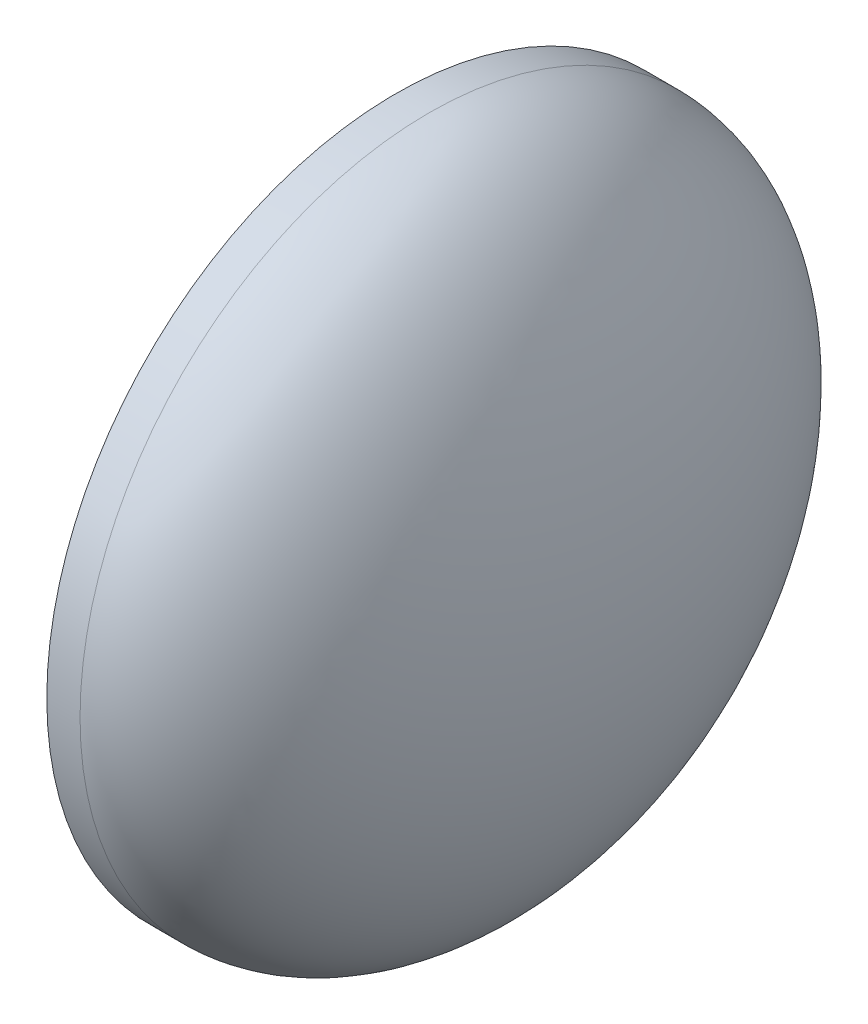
from build123d import *


with BuildPart() as part:
    # Sketch1 → Revolve1 (revolve)
    with BuildSketch(Plane.XY, mode=Mode.PRIVATE) as revolve1_sk:
        with BuildLine():
            Line((1828.8, 533.4), (1828.8, 520.7))
            Line((1828.8, 520.7), (1879.6, 520.7))
            add(Edge.make_bspline(
                [(1879.6, 520.7), (1883.666235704, 520.7), (1891.78356429, 520.3106341), (1908.027304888, 517.971460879), (1928.297729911, 512.10771747), (1952.453420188, 500.303799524), (1984.136113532, 478.184705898), (2022.053710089, 438.687396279), (2062.534499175, 373.859954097), (2096.032039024, 294.175191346), (2116.867805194, 218.050214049), (2128.756111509, 153.141666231), (2135.193453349, 102.944785), (2138.434393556, 60.263439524), (2139.733302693, 25.86538255), (2139.95, 8.618485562), (2139.95, 0)],
                knots=[-1.570796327, -1.570796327, -1.570796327, -1.570796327, -1.521708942, -1.472621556, -1.374446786, -1.276272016, -1.178097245, -0.981747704, -0.785398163, -0.589048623, -0.392699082, -0.294524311, -0.196349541, -0.09817477, -0.049087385, 0, 0, 0, 0], degree=3))
            Line((2139.95, 0), (2152.65, 0))
            add(Edge.make_bspline(
                [(2152.65, 0), (2152.65, 533.4), (1879.6, 533.4)],
                knots=[4.71238898, 4.71238898, 4.71238898, 6.283185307, 6.283185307, 6.283185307], degree=2, weights=[1, 0.707106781, 1]))
            Line((1879.6, 533.4), (1828.8, 533.4))
        make_face()
    revolve(revolve1_sk.sketch.rotate(Axis((1828.8, 0, 0), (1, 0, 0)), 90), axis=Axis((1828.8, 0, 0), (1, 0, 0)))


solid = part.part
